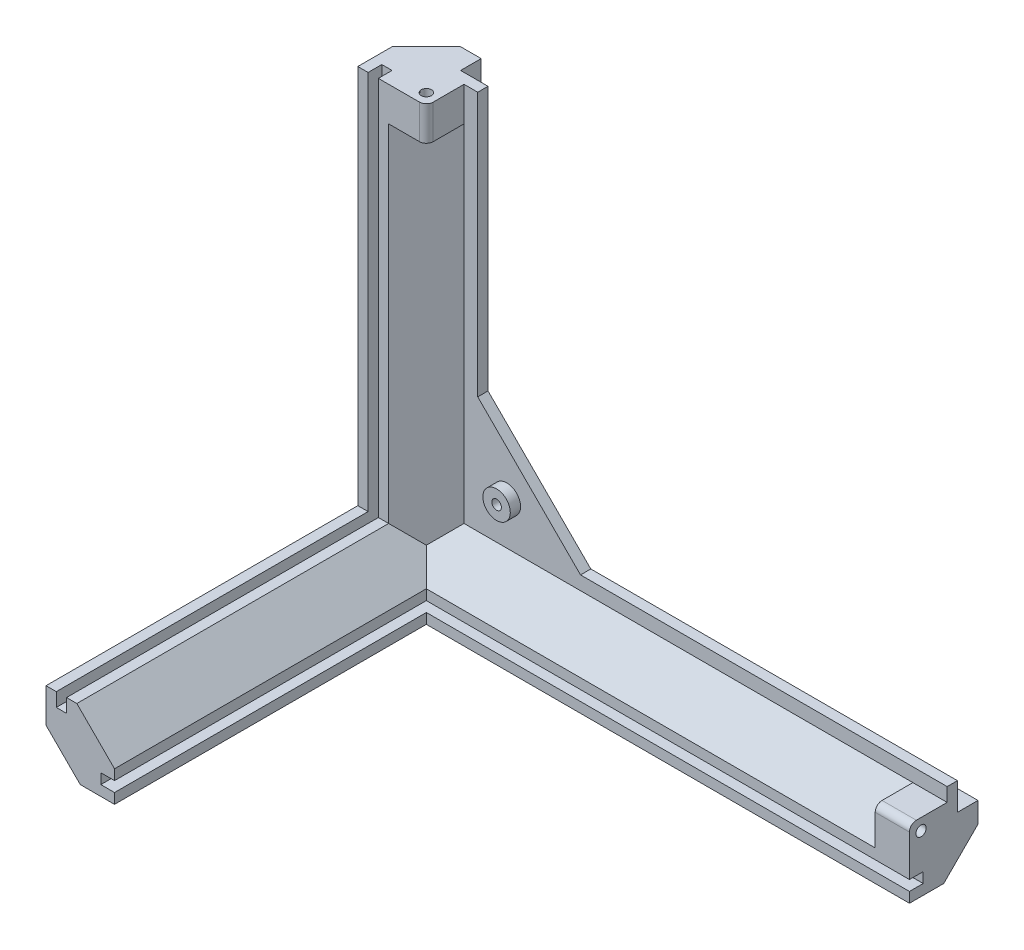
ISO-10303-21;
HEADER;
FILE_DESCRIPTION(('STEP AP214'),'2;1');
FILE_NAME('part.step','',(''),(''),'','','');
FILE_SCHEMA(('AUTOMOTIVE_DESIGN { 1 0 10303 214 1 1 1 1 }'));
ENDSEC;
DATA;
#1=APPLICATION_CONTEXT('core data for automotive mechanical design processes');
#2=APPLICATION_PROTOCOL_DEFINITION('international standard','automotive_design',2000,#1);
#3=PRODUCT_CONTEXT('',#1,'mechanical');
#4=PRODUCT('Part','Part','',(#3));
#5=PRODUCT_RELATED_PRODUCT_CATEGORY('part','',(#4));
#6=PRODUCT_DEFINITION_FORMATION('','',#4);
#7=PRODUCT_DEFINITION_CONTEXT('part definition',#1,'design');
#8=PRODUCT_DEFINITION('design','',#6,#7);
#9=PRODUCT_DEFINITION_SHAPE('','',#8);
#10=(LENGTH_UNIT() NAMED_UNIT(*) SI_UNIT(.MILLI.,.METRE.));
#11=(NAMED_UNIT(*) PLANE_ANGLE_UNIT() SI_UNIT($,.RADIAN.));
#12=(NAMED_UNIT(*) SI_UNIT($,.STERADIAN.) SOLID_ANGLE_UNIT());
#13=UNCERTAINTY_MEASURE_WITH_UNIT(LENGTH_MEASURE(1.E-05),#10,'distance_accuracy_value','');
#14=(GEOMETRIC_REPRESENTATION_CONTEXT(3) GLOBAL_UNCERTAINTY_ASSIGNED_CONTEXT((#13)) GLOBAL_UNIT_ASSIGNED_CONTEXT((#10,
#11,#12)) REPRESENTATION_CONTEXT('',''));
#15=CARTESIAN_POINT('',(0.,0.,0.));
#16=DIRECTION('',(0.,0.,1.));
#17=DIRECTION('',(1.,0.,0.));
#18=AXIS2_PLACEMENT_3D('',#15,#16,#17);
#19=CARTESIAN_POINT('',(100.942130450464,4.,-4.45226686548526));
#20=DIRECTION('',(0.,0.,-1.));
#21=DIRECTION('',(-1.,0.,0.));
#22=AXIS2_PLACEMENT_3D('',#19,#20,#21);
#23=PLANE('',#22);
#24=DIRECTION('',(-1.,0.,0.));
#25=VECTOR('',#24,1.);
#26=CARTESIAN_POINT('',(100.942130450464,0.,-4.45226686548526));
#27=LINE('',#26,#25);
#28=CARTESIAN_POINT('',(100.942130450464,0.,-4.45226686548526));
#29=VERTEX_POINT('',#28);
#30=CARTESIAN_POINT('',(90.9421304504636,0.,-4.45226686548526));
#31=VERTEX_POINT('',#30);
#32=EDGE_CURVE('E304',#29,#31,#27,.T.);
#33=ORIENTED_EDGE('',*,*,#32,.F.);
#34=DIRECTION('',(0.,-1.,0.));
#35=VECTOR('',#34,1.);
#36=CARTESIAN_POINT('',(100.942130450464,4.,-4.45226686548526));
#37=LINE('',#36,#35);
#38=CARTESIAN_POINT('',(100.942130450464,4.,-4.45226686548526));
#39=VERTEX_POINT('',#38);
#40=EDGE_CURVE('E398',#39,#29,#37,.T.);
#41=ORIENTED_EDGE('',*,*,#40,.F.);
#42=DIRECTION('',(1.,0.,0.));
#43=VECTOR('',#42,1.);
#44=CARTESIAN_POINT('',(100.942130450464,4.,-4.45226686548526));
#45=LINE('',#44,#43);
#46=CARTESIAN_POINT('',(-6.05786954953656,4.,-4.45226686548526));
#47=VERTEX_POINT('',#46);
#48=EDGE_CURVE('E387',#47,#39,#45,.T.);
#49=ORIENTED_EDGE('',*,*,#48,.F.);
#50=DIRECTION('',(-0.707106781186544,0.707106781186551,0.));
#51=VECTOR('',#50,1.);
#52=CARTESIAN_POINT('',(47.4421304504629,-49.5000000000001,-4.45226686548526));
#53=LINE('',#52,#51);
#54=CARTESIAN_POINT('',(-36.0578695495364,34.0000000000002,-4.45226686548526));
#55=VERTEX_POINT('',#54);
#56=EDGE_CURVE('E684',#47,#55,#53,.T.);
#57=ORIENTED_EDGE('',*,*,#56,.T.);
#58=DIRECTION('',(0.,-1.,0.));
#59=VECTOR('',#58,1.);
#60=CARTESIAN_POINT('',(-36.0578695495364,111.,-4.45226686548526));
#61=LINE('',#60,#59);
#62=CARTESIAN_POINT('',(-36.0578695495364,111.,-4.45226686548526));
#63=VERTEX_POINT('',#62);
#64=EDGE_CURVE('E373',#63,#55,#61,.T.);
#65=ORIENTED_EDGE('',*,*,#64,.F.);
#66=DIRECTION('',(-1.,0.,0.));
#67=VECTOR('',#66,1.);
#68=CARTESIAN_POINT('',(-36.0578695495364,111.,-4.45226686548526));
#69=LINE('',#68,#67);
#70=CARTESIAN_POINT('',(-40.0578695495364,111.,-4.45226686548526));
#71=VERTEX_POINT('',#70);
#72=EDGE_CURVE('E383',#63,#71,#69,.T.);
#73=ORIENTED_EDGE('',*,*,#72,.T.);
#74=DIRECTION('',(0.,-1.,0.));
#75=VECTOR('',#74,1.);
#76=CARTESIAN_POINT('',(-40.0578695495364,111.,-4.45226686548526));
#77=LINE('',#76,#75);
#78=CARTESIAN_POINT('',(-40.0578695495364,101.,-4.45226686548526));
#79=VERTEX_POINT('',#78);
#80=EDGE_CURVE('E637',#71,#79,#77,.T.);
#81=ORIENTED_EDGE('',*,*,#80,.T.);
#82=CARTESIAN_POINT('',(-40.0578695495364,0.,-4.45226686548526));
#83=VERTEX_POINT('',#82);
#84=EDGE_CURVE('E308',#79,#83,#77,.T.);
#85=ORIENTED_EDGE('',*,*,#84,.T.);
#86=EDGE_CURVE('E299',#31,#83,#27,.T.);
#87=ORIENTED_EDGE('',*,*,#86,.F.);
#88=EDGE_LOOP('',(#33,#41,#49,#57,#65,#73,#81,#85,#87));
#89=FACE_BOUND('',#88,.T.);
#90=CARTESIAN_POINT('',(-27.5578695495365,12.5000000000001,-4.45226686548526));
#91=DIRECTION('',(0.,0.,-1.));
#92=DIRECTION('',(-1.,0.,0.));
#93=AXIS2_PLACEMENT_3D('',#90,#91,#92);
#94=CIRCLE('',#93,4.);
#95=CARTESIAN_POINT('',(-31.5578695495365,12.5000000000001,-4.45226686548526));
#96=VERTEX_POINT('',#95);
#97=EDGE_CURVE('E12',#96,#96,#94,.F.);
#98=ORIENTED_EDGE('',*,*,#97,.F.);
#99=EDGE_LOOP('',(#98));
#100=FACE_BOUND('',#99,.T.);
#101=ADVANCED_FACE('F53',(#89,#100),#23,.F.);
#102=CARTESIAN_POINT('',(-40.0578695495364,111.,-4.45226686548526));
#103=DIRECTION('',(-0.707106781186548,0.,-0.707106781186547));
#104=DIRECTION('',(-0.707106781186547,0.,0.707106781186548));
#105=AXIS2_PLACEMENT_3D('',#102,#103,#104);
#106=PLANE('',#105);
#107=DIRECTION('',(0.707106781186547,0.,-0.707106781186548));
#108=VECTOR('',#107,1.);
#109=CARTESIAN_POINT('',(-22.2550682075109,101.,-22.2550682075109));
#110=LINE('',#109,#108);
#111=CARTESIAN_POINT('',(-51.0578695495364,101.,6.54773313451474));
#112=VERTEX_POINT('',#111);
#113=EDGE_CURVE('E360',#112,#79,#110,.T.);
#114=ORIENTED_EDGE('',*,*,#113,.F.);
#115=DIRECTION('',(0.,-1.,0.));
#116=VECTOR('',#115,1.);
#117=CARTESIAN_POINT('',(-51.0578695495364,111.,6.54773313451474));
#118=LINE('',#117,#116);
#119=CARTESIAN_POINT('',(-51.0578695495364,0.,6.54773313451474));
#120=VERTEX_POINT('',#119);
#121=EDGE_CURVE('E640',#112,#120,#118,.T.);
#122=ORIENTED_EDGE('',*,*,#121,.T.);
#123=DIRECTION('',(-0.577350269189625,0.577350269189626,0.577350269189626));
#124=VECTOR('',#123,1.);
#125=CARTESIAN_POINT('',(-80.7245362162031,29.6666666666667,36.2143998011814));
#126=LINE('',#125,#124);
#127=CARTESIAN_POINT('',(-45.5578695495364,-5.49999999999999,1.04773313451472));
#128=VERTEX_POINT('',#127);
#129=EDGE_CURVE('E411',#128,#120,#126,.T.);
#130=ORIENTED_EDGE('',*,*,#129,.F.);
#131=DIRECTION('',(-0.577350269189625,-0.577350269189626,0.577350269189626));
#132=VECTOR('',#131,1.);
#133=CARTESIAN_POINT('',(-3.05786954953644,37.,-41.4522668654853));
#134=LINE('',#133,#132);
#135=EDGE_CURVE('E415',#83,#128,#134,.T.);
#136=ORIENTED_EDGE('',*,*,#135,.F.);
#137=ORIENTED_EDGE('',*,*,#84,.F.);
#138=EDGE_LOOP('',(#114,#122,#130,#136,#137));
#139=FACE_BOUND('',#138,.T.);
#140=ADVANCED_FACE('F744',(#139),#106,.F.);
#141=CARTESIAN_POINT('',(100.942130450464,-11.,6.54773313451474));
#142=DIRECTION('',(0.,-0.707106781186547,-0.707106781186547));
#143=DIRECTION('',(0.,0.707106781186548,-0.707106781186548));
#144=AXIS2_PLACEMENT_3D('',#141,#142,#143);
#145=PLANE('',#144);
#146=DIRECTION('',(-1.,0.,0.));
#147=VECTOR('',#146,1.);
#148=CARTESIAN_POINT('',(100.942130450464,-11.,6.54773313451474));
#149=LINE('',#148,#147);
#150=CARTESIAN_POINT('',(90.9421304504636,-11.,6.54773313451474));
#151=VERTEX_POINT('',#150);
#152=CARTESIAN_POINT('',(-40.0578695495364,-11.,6.54773313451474));
#153=VERTEX_POINT('',#152);
#154=EDGE_CURVE('E320',#151,#153,#149,.T.);
#155=ORIENTED_EDGE('',*,*,#154,.F.);
#156=DIRECTION('',(0.,0.707106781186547,-0.707106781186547));
#157=VECTOR('',#156,1.);
#158=CARTESIAN_POINT('',(90.9421304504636,-11.,6.54773313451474));
#159=LINE('',#158,#157);
#160=EDGE_CURVE('E317',#151,#31,#159,.T.);
#161=ORIENTED_EDGE('',*,*,#160,.T.);
#162=ORIENTED_EDGE('',*,*,#86,.T.);
#163=ORIENTED_EDGE('',*,*,#135,.T.);
#164=DIRECTION('',(-0.577350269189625,0.577350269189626,-0.577350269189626));
#165=VECTOR('',#164,1.);
#166=CARTESIAN_POINT('',(6.94213045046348,-58.,53.5477331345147));
#167=LINE('',#166,#165);
#168=EDGE_CURVE('E408',#153,#128,#167,.T.);
#169=ORIENTED_EDGE('',*,*,#168,.F.);
#170=EDGE_LOOP('',(#155,#161,#162,#163,#169));
#171=FACE_BOUND('',#170,.T.);
#172=ADVANCED_FACE('F318',(#171),#145,.F.);
#173=CARTESIAN_POINT('',(-40.0578695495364,111.,-7.45226686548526));
#174=DIRECTION('',(-1.,0.,0.));
#175=DIRECTION('',(0.,0.,1.));
#176=AXIS2_PLACEMENT_3D('',#173,#174,#175);
#177=PLANE('',#176);
#178=DIRECTION('',(0.,-1.,0.));
#179=VECTOR('',#178,1.);
#180=CARTESIAN_POINT('',(-40.0578695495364,-17.,6.54773313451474));
#181=LINE('',#180,#179);
#182=CARTESIAN_POINT('',(-40.0578695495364,-17.,6.54773313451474));
#183=VERTEX_POINT('',#182);
#184=CARTESIAN_POINT('',(-40.0578695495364,-20.,6.54773313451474));
#185=VERTEX_POINT('',#184);
#186=EDGE_CURVE('E435',#183,#185,#181,.T.);
#187=ORIENTED_EDGE('',*,*,#186,.F.);
#188=DIRECTION('',(0.,0.,-1.));
#189=VECTOR('',#188,1.);
#190=CARTESIAN_POINT('',(-40.0578695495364,-17.,97.5477331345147));
#191=LINE('',#190,#189);
#192=CARTESIAN_POINT('',(-40.0578695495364,-17.,97.5477331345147));
#193=VERTEX_POINT('',#192);
#194=EDGE_CURVE('E568',#193,#183,#191,.T.);
#195=ORIENTED_EDGE('',*,*,#194,.F.);
#196=DIRECTION('',(0.,1.,0.));
#197=VECTOR('',#196,1.);
#198=CARTESIAN_POINT('',(-40.0578695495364,-20.,97.5477331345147));
#199=LINE('',#198,#197);
#200=CARTESIAN_POINT('',(-40.0578695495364,-20.,97.5477331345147));
#201=VERTEX_POINT('',#200);
#202=EDGE_CURVE('E527',#201,#193,#199,.T.);
#203=ORIENTED_EDGE('',*,*,#202,.F.);
#204=DIRECTION('',(0.,0.,-1.));
#205=VECTOR('',#204,1.);
#206=CARTESIAN_POINT('',(-40.0578695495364,-20.,6.54773313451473));
#207=LINE('',#206,#205);
#208=EDGE_CURVE('E600',#201,#185,#207,.T.);
#209=ORIENTED_EDGE('',*,*,#208,.T.);
#210=EDGE_LOOP('',(#187,#195,#203,#209));
#211=FACE_BOUND('',#210,.T.);
#212=ADVANCED_FACE('F784',(#211),#177,.F.);
#213=DIRECTION('',(0.,-1.,0.));
#214=VECTOR('',#213,1.);
#215=CARTESIAN_POINT('',(-40.0578695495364,-11.,6.54773313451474));
#216=LINE('',#215,#214);
#217=CARTESIAN_POINT('',(-40.0578695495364,-14.,6.54773313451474));
#218=VERTEX_POINT('',#217);
#219=EDGE_CURVE('E430',#153,#218,#216,.T.);
#220=ORIENTED_EDGE('',*,*,#219,.F.);
#221=DIRECTION('',(0.,0.,-1.));
#222=VECTOR('',#221,1.);
#223=CARTESIAN_POINT('',(-40.0578695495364,-11.,97.5477331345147));
#224=LINE('',#223,#222);
#225=CARTESIAN_POINT('',(-40.0578695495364,-11.,97.5477331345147));
#226=VERTEX_POINT('',#225);
#227=EDGE_CURVE('E555',#226,#153,#224,.T.);
#228=ORIENTED_EDGE('',*,*,#227,.F.);
#229=DIRECTION('',(0.,1.,0.));
#230=VECTOR('',#229,1.);
#231=CARTESIAN_POINT('',(-40.0578695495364,-14.,97.5477331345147));
#232=LINE('',#231,#230);
#233=CARTESIAN_POINT('',(-40.0578695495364,-14.,97.5477331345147));
#234=VERTEX_POINT('',#233);
#235=EDGE_CURVE('E539',#234,#226,#232,.T.);
#236=ORIENTED_EDGE('',*,*,#235,.F.);
#237=DIRECTION('',(0.,0.,-1.));
#238=VECTOR('',#237,1.);
#239=CARTESIAN_POINT('',(-40.0578695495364,-14.,97.5477331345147));
#240=LINE('',#239,#238);
#241=EDGE_CURVE('E559',#234,#218,#240,.T.);
#242=ORIENTED_EDGE('',*,*,#241,.T.);
#243=EDGE_LOOP('',(#220,#228,#236,#242));
#244=FACE_BOUND('',#243,.T.);
#245=ADVANCED_FACE('F837',(#244),#177,.F.);
#246=CARTESIAN_POINT('',(-54.0578695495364,111.,6.54773313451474));
#247=DIRECTION('',(0.,0.,-1.));
#248=DIRECTION('',(-1.,0.,0.));
#249=AXIS2_PLACEMENT_3D('',#246,#247,#248);
#250=PLANE('',#249);
#251=DIRECTION('',(-1.,0.,0.));
#252=VECTOR('',#251,1.);
#253=CARTESIAN_POINT('',(0.,101.,6.54773313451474));
#254=LINE('',#253,#252);
#255=CARTESIAN_POINT('',(-42.0578695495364,101.,6.54773313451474));
#256=VERTEX_POINT('',#255);
#257=EDGE_CURVE('E364',#256,#112,#254,.T.);
#258=ORIENTED_EDGE('',*,*,#257,.F.);
#259=DIRECTION('',(0.,1.,0.));
#260=VECTOR('',#259,1.);
#261=CARTESIAN_POINT('',(-42.0578695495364,111.,6.54773313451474));
#262=LINE('',#261,#260);
#263=CARTESIAN_POINT('',(-42.0578695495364,111.,6.54773313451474));
#264=VERTEX_POINT('',#263);
#265=EDGE_CURVE('E711',#256,#264,#262,.T.);
#266=ORIENTED_EDGE('',*,*,#265,.T.);
#267=DIRECTION('',(1.,0.,0.));
#268=VECTOR('',#267,1.);
#269=CARTESIAN_POINT('',(-54.0578695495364,111.,6.54773313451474));
#270=LINE('',#269,#268);
#271=CARTESIAN_POINT('',(-54.0578695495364,111.,6.54773313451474));
#272=VERTEX_POINT('',#271);
#273=EDGE_CURVE('E624',#272,#264,#270,.T.);
#274=ORIENTED_EDGE('',*,*,#273,.F.);
#275=DIRECTION('',(0.,-1.,0.));
#276=VECTOR('',#275,1.);
#277=CARTESIAN_POINT('',(-54.0578695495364,111.,6.54773313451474));
#278=LINE('',#277,#276);
#279=CARTESIAN_POINT('',(-54.0578695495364,0.,6.54773313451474));
#280=VERTEX_POINT('',#279);
#281=EDGE_CURVE('E643',#272,#280,#278,.T.);
#282=ORIENTED_EDGE('',*,*,#281,.T.);
#283=DIRECTION('',(-1.,0.,0.));
#284=VECTOR('',#283,1.);
#285=CARTESIAN_POINT('',(-54.0578695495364,0.,6.54773313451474));
#286=LINE('',#285,#284);
#287=EDGE_CURVE('E499',#120,#280,#286,.T.);
#288=ORIENTED_EDGE('',*,*,#287,.F.);
#289=ORIENTED_EDGE('',*,*,#121,.F.);
#290=EDGE_LOOP('',(#258,#266,#274,#282,#288,#289));
#291=FACE_BOUND('',#290,.T.);
#292=ADVANCED_FACE('F728',(#291),#250,.F.);
#293=DIRECTION('',(-1.,0.,0.));
#294=VECTOR('',#293,1.);
#295=CARTESIAN_POINT('',(-57.0578695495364,0.,6.54773313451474));
#296=LINE('',#295,#294);
#297=CARTESIAN_POINT('',(-57.0578695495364,0.,6.54773313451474));
#298=VERTEX_POINT('',#297);
#299=CARTESIAN_POINT('',(-60.0578695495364,0.,6.54773313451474));
#300=VERTEX_POINT('',#299);
#301=EDGE_CURVE('E505',#298,#300,#296,.T.);
#302=ORIENTED_EDGE('',*,*,#301,.F.);
#303=DIRECTION('',(0.,-1.,0.));
#304=VECTOR('',#303,1.);
#305=CARTESIAN_POINT('',(-57.0578695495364,111.,6.54773313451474));
#306=LINE('',#305,#304);
#307=CARTESIAN_POINT('',(-57.0578695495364,111.,6.54773313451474));
#308=VERTEX_POINT('',#307);
#309=EDGE_CURVE('E652',#308,#298,#306,.T.);
#310=ORIENTED_EDGE('',*,*,#309,.F.);
#311=DIRECTION('',(1.,0.,0.));
#312=VECTOR('',#311,1.);
#313=CARTESIAN_POINT('',(-60.0578695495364,111.,6.54773313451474));
#314=LINE('',#313,#312);
#315=CARTESIAN_POINT('',(-60.0578695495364,111.,6.54773313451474));
#316=VERTEX_POINT('',#315);
#317=EDGE_CURVE('E612',#316,#308,#314,.T.);
#318=ORIENTED_EDGE('',*,*,#317,.F.);
#319=DIRECTION('',(0.,-1.,0.));
#320=VECTOR('',#319,1.);
#321=CARTESIAN_POINT('',(-60.0578695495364,111.,6.54773313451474));
#322=LINE('',#321,#320);
#323=EDGE_CURVE('E656',#316,#300,#322,.T.);
#324=ORIENTED_EDGE('',*,*,#323,.T.);
#325=EDGE_LOOP('',(#302,#310,#318,#324));
#326=FACE_BOUND('',#325,.T.);
#327=ADVANCED_FACE('F841',(#326),#250,.F.);
#328=CARTESIAN_POINT('',(-50.0578695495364,111.,-13.4522668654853));
#329=DIRECTION('',(0.,0.,1.));
#330=DIRECTION('',(1.,0.,0.));
#331=AXIS2_PLACEMENT_3D('',#328,#329,#330);
#332=PLANE('',#331);
#333=DIRECTION('',(0.,-1.,0.));
#334=VECTOR('',#333,1.);
#335=CARTESIAN_POINT('',(-44.0578695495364,111.,-13.4522668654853));
#336=LINE('',#335,#334);
#337=CARTESIAN_POINT('',(-44.0578695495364,111.,-13.4522668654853));
#338=VERTEX_POINT('',#337);
#339=CARTESIAN_POINT('',(-44.0578695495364,16.0000000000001,-13.4522668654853));
#340=VERTEX_POINT('',#339);
#341=EDGE_CURVE('E404',#338,#340,#336,.T.);
#342=ORIENTED_EDGE('',*,*,#341,.T.);
#343=DIRECTION('',(-0.707106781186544,0.707106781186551,0.));
#344=VECTOR('',#343,1.);
#345=CARTESIAN_POINT('',(-94.5578695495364,66.5000000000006,-13.4522668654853));
#346=LINE('',#345,#344);
#347=CARTESIAN_POINT('',(-24.0578695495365,-4.,-13.4522668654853));
#348=VERTEX_POINT('',#347);
#349=EDGE_CURVE('E697',#340,#348,#346,.F.);
#350=ORIENTED_EDGE('',*,*,#349,.T.);
#351=DIRECTION('',(1.,0.,0.));
#352=VECTOR('',#351,1.);
#353=CARTESIAN_POINT('',(-50.0578695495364,-4.,-13.4522668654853));
#354=LINE('',#353,#352);
#355=CARTESIAN_POINT('',(100.942130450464,-4.,-13.4522668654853));
#356=VERTEX_POINT('',#355);
#357=EDGE_CURVE('E401',#348,#356,#354,.T.);
#358=ORIENTED_EDGE('',*,*,#357,.T.);
#359=DIRECTION('',(0.,1.,0.));
#360=VECTOR('',#359,1.);
#361=CARTESIAN_POINT('',(100.942130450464,0.,-13.4522668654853));
#362=LINE('',#361,#360);
#363=CARTESIAN_POINT('',(100.942130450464,-10.,-13.4522668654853));
#364=VERTEX_POINT('',#363);
#365=EDGE_CURVE('E453',#364,#356,#362,.T.);
#366=ORIENTED_EDGE('',*,*,#365,.F.);
#367=DIRECTION('',(-1.,0.,0.));
#368=VECTOR('',#367,1.);
#369=CARTESIAN_POINT('',(100.942130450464,-10.,-13.4522668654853));
#370=LINE('',#369,#368);
#371=CARTESIAN_POINT('',(-50.0578695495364,-9.99999999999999,-13.4522668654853));
#372=VERTEX_POINT('',#371);
#373=EDGE_CURVE('E471',#364,#372,#370,.T.);
#374=ORIENTED_EDGE('',*,*,#373,.T.);
#375=DIRECTION('',(0.,-1.,0.));
#376=VECTOR('',#375,1.);
#377=CARTESIAN_POINT('',(-50.0578695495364,111.,-13.4522668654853));
#378=LINE('',#377,#376);
#379=CARTESIAN_POINT('',(-50.0578695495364,111.,-13.4522668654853));
#380=VERTEX_POINT('',#379);
#381=EDGE_CURVE('E662',#380,#372,#378,.T.);
#382=ORIENTED_EDGE('',*,*,#381,.F.);
#383=DIRECTION('',(-1.,0.,0.));
#384=VECTOR('',#383,1.);
#385=CARTESIAN_POINT('',(-50.0578695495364,111.,-13.4522668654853));
#386=LINE('',#385,#384);
#387=EDGE_CURVE('E603',#338,#380,#386,.T.);
#388=ORIENTED_EDGE('',*,*,#387,.F.);
#389=EDGE_LOOP('',(#342,#350,#358,#366,#374,#382,#388));
#390=FACE_BOUND('',#389,.T.);
#391=ADVANCED_FACE('F860',(#390),#332,.F.);
#392=CARTESIAN_POINT('',(-60.0578695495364,111.,-3.45226686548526));
#393=DIRECTION('',(0.707106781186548,0.,0.707106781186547));
#394=DIRECTION('',(0.707106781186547,0.,-0.707106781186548));
#395=AXIS2_PLACEMENT_3D('',#392,#393,#394);
#396=PLANE('',#395);
#397=ORIENTED_EDGE('',*,*,#381,.T.);
#398=DIRECTION('',(-0.577350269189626,-0.577350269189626,0.577350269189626));
#399=VECTOR('',#398,1.);
#400=CARTESIAN_POINT('',(-16.3912028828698,23.6666666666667,-47.1189335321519));
#401=LINE('',#400,#399);
#402=CARTESIAN_POINT('',(-55.0578695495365,-15.,-8.45226686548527));
#403=VERTEX_POINT('',#402);
#404=EDGE_CURVE('E426',#372,#403,#401,.T.);
#405=ORIENTED_EDGE('',*,*,#404,.T.);
#406=DIRECTION('',(0.577350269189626,-0.577350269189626,-0.577350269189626));
#407=VECTOR('',#406,1.);
#408=CARTESIAN_POINT('',(-87.0578695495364,17.,23.5477331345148));
#409=LINE('',#408,#407);
#410=CARTESIAN_POINT('',(-60.0578695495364,-10.,-3.45226686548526));
#411=VERTEX_POINT('',#410);
#412=EDGE_CURVE('E666',#411,#403,#409,.T.);
#413=ORIENTED_EDGE('',*,*,#412,.F.);
#414=DIRECTION('',(0.,-1.,0.));
#415=VECTOR('',#414,1.);
#416=CARTESIAN_POINT('',(-60.0578695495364,111.,-3.45226686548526));
#417=LINE('',#416,#415);
#418=CARTESIAN_POINT('',(-60.0578695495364,111.,-3.45226686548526));
#419=VERTEX_POINT('',#418);
#420=EDGE_CURVE('E659',#419,#411,#417,.T.);
#421=ORIENTED_EDGE('',*,*,#420,.F.);
#422=DIRECTION('',(-0.707106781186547,0.,0.707106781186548));
#423=VECTOR('',#422,1.);
#424=CARTESIAN_POINT('',(-60.0578695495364,111.,-3.45226686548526));
#425=LINE('',#424,#423);
#426=EDGE_CURVE('E606',#380,#419,#425,.T.);
#427=ORIENTED_EDGE('',*,*,#426,.F.);
#428=EDGE_LOOP('',(#397,#405,#413,#421,#427));
#429=FACE_BOUND('',#428,.T.);
#430=ADVANCED_FACE('F856',(#429),#396,.F.);
#431=CARTESIAN_POINT('',(-60.0578695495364,111.,-3.45226686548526));
#432=DIRECTION('',(1.,0.,0.));
#433=DIRECTION('',(0.,0.,-1.));
#434=AXIS2_PLACEMENT_3D('',#431,#432,#433);
#435=PLANE('',#434);
#436=ORIENTED_EDGE('',*,*,#420,.T.);
#437=DIRECTION('',(0.,0.,-1.));
#438=VECTOR('',#437,1.);
#439=CARTESIAN_POINT('',(-60.0578695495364,-10.,97.5477331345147));
#440=LINE('',#439,#438);
#441=CARTESIAN_POINT('',(-60.0578695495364,-10.,97.5477331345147));
#442=VERTEX_POINT('',#441);
#443=EDGE_CURVE('E576',#442,#411,#440,.T.);
#444=ORIENTED_EDGE('',*,*,#443,.F.);
#445=DIRECTION('',(0.,-1.,0.));
#446=VECTOR('',#445,1.);
#447=CARTESIAN_POINT('',(-60.0578695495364,0.,97.5477331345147));
#448=LINE('',#447,#446);
#449=CARTESIAN_POINT('',(-60.0578695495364,0.,97.5477331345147));
#450=VERTEX_POINT('',#449);
#451=EDGE_CURVE('E517',#450,#442,#448,.T.);
#452=ORIENTED_EDGE('',*,*,#451,.F.);
#453=DIRECTION('',(0.,0.,-1.));
#454=VECTOR('',#453,1.);
#455=CARTESIAN_POINT('',(-60.0578695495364,0.,97.5477331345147));
#456=LINE('',#455,#454);
#457=EDGE_CURVE('E580',#450,#300,#456,.T.);
#458=ORIENTED_EDGE('',*,*,#457,.T.);
#459=ORIENTED_EDGE('',*,*,#323,.F.);
#460=DIRECTION('',(0.,0.,1.));
#461=VECTOR('',#460,1.);
#462=CARTESIAN_POINT('',(-60.0578695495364,111.,-3.45226686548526));
#463=LINE('',#462,#461);
#464=EDGE_CURVE('E609',#419,#316,#463,.T.);
#465=ORIENTED_EDGE('',*,*,#464,.F.);
#466=EDGE_LOOP('',(#436,#444,#452,#458,#459,#465));
#467=FACE_BOUND('',#466,.T.);
#468=ADVANCED_FACE('F852',(#467),#435,.F.);
#469=CARTESIAN_POINT('',(-57.0578695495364,111.,6.54773313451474));
#470=DIRECTION('',(-1.,0.,0.));
#471=DIRECTION('',(0.,0.,1.));
#472=AXIS2_PLACEMENT_3D('',#469,#470,#471);
#473=PLANE('',#472);
#474=ORIENTED_EDGE('',*,*,#309,.T.);
#475=DIRECTION('',(0.,0.,-1.));
#476=VECTOR('',#475,1.);
#477=CARTESIAN_POINT('',(-57.0578695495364,0.,97.5477331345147));
#478=LINE('',#477,#476);
#479=CARTESIAN_POINT('',(-57.0578695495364,0.,97.5477331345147));
#480=VERTEX_POINT('',#479);
#481=EDGE_CURVE('E584',#480,#298,#478,.T.);
#482=ORIENTED_EDGE('',*,*,#481,.F.);
#483=DIRECTION('',(0.,1.,0.));
#484=VECTOR('',#483,1.);
#485=CARTESIAN_POINT('',(-57.0578695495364,0.,97.5477331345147));
#486=LINE('',#485,#484);
#487=CARTESIAN_POINT('',(-57.0578695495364,-4.,97.5477331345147));
#488=VERTEX_POINT('',#487);
#489=EDGE_CURVE('E511',#488,#480,#486,.T.);
#490=ORIENTED_EDGE('',*,*,#489,.F.);
#491=DIRECTION('',(0.,0.,-1.));
#492=VECTOR('',#491,1.);
#493=CARTESIAN_POINT('',(-57.0578695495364,-4.,97.5477331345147));
#494=LINE('',#493,#492);
#495=CARTESIAN_POINT('',(-57.0578695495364,-3.99999999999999,2.54773313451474));
#496=VERTEX_POINT('',#495);
#497=EDGE_CURVE('E588',#488,#496,#494,.T.);
#498=ORIENTED_EDGE('',*,*,#497,.T.);
#499=DIRECTION('',(0.,-1.,0.));
#500=VECTOR('',#499,1.);
#501=CARTESIAN_POINT('',(-57.0578695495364,111.,2.54773313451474));
#502=LINE('',#501,#500);
#503=CARTESIAN_POINT('',(-57.0578695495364,111.,2.54773313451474));
#504=VERTEX_POINT('',#503);
#505=EDGE_CURVE('E649',#504,#496,#502,.T.);
#506=ORIENTED_EDGE('',*,*,#505,.F.);
#507=DIRECTION('',(0.,0.,-1.));
#508=VECTOR('',#507,1.);
#509=CARTESIAN_POINT('',(-57.0578695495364,111.,6.54773313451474));
#510=LINE('',#509,#508);
#511=EDGE_CURVE('E615',#308,#504,#510,.T.);
#512=ORIENTED_EDGE('',*,*,#511,.F.);
#513=EDGE_LOOP('',(#474,#482,#490,#498,#506,#512));
#514=FACE_BOUND('',#513,.T.);
#515=ADVANCED_FACE('F848',(#514),#473,.F.);
#516=CARTESIAN_POINT('',(-57.0578695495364,111.,2.54773313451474));
#517=DIRECTION('',(0.,0.,-1.));
#518=DIRECTION('',(-1.,0.,0.));
#519=AXIS2_PLACEMENT_3D('',#516,#517,#518);
#520=PLANE('',#519);
#521=ORIENTED_EDGE('',*,*,#505,.T.);
#522=DIRECTION('',(-1.,0.,0.));
#523=VECTOR('',#522,1.);
#524=CARTESIAN_POINT('',(-57.0578695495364,-3.99999999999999,2.54773313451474));
#525=LINE('',#524,#523);
#526=CARTESIAN_POINT('',(-54.0578695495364,-3.99999999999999,2.54773313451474));
#527=VERTEX_POINT('',#526);
#528=EDGE_CURVE('E418',#527,#496,#525,.T.);
#529=ORIENTED_EDGE('',*,*,#528,.F.);
#530=DIRECTION('',(0.,-1.,0.));
#531=VECTOR('',#530,1.);
#532=CARTESIAN_POINT('',(-54.0578695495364,111.,2.54773313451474));
#533=LINE('',#532,#531);
#534=CARTESIAN_POINT('',(-54.0578695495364,111.,2.54773313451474));
#535=VERTEX_POINT('',#534);
#536=EDGE_CURVE('E646',#535,#527,#533,.T.);
#537=ORIENTED_EDGE('',*,*,#536,.F.);
#538=DIRECTION('',(1.,0.,0.));
#539=VECTOR('',#538,1.);
#540=CARTESIAN_POINT('',(-57.0578695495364,111.,2.54773313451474));
#541=LINE('',#540,#539);
#542=EDGE_CURVE('E618',#504,#535,#541,.T.);
#543=ORIENTED_EDGE('',*,*,#542,.F.);
#544=EDGE_LOOP('',(#521,#529,#537,#543));
#545=FACE_BOUND('',#544,.T.);
#546=ADVANCED_FACE('F844',(#545),#520,.F.);
#547=CARTESIAN_POINT('',(-54.0578695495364,111.,2.54773313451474));
#548=DIRECTION('',(1.,0.,0.));
#549=DIRECTION('',(0.,0.,-1.));
#550=AXIS2_PLACEMENT_3D('',#547,#548,#549);
#551=PLANE('',#550);
#552=ORIENTED_EDGE('',*,*,#536,.T.);
#553=DIRECTION('',(0.,0.,-1.));
#554=VECTOR('',#553,1.);
#555=CARTESIAN_POINT('',(-54.0578695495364,-4.,97.5477331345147));
#556=LINE('',#555,#554);
#557=CARTESIAN_POINT('',(-54.0578695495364,-4.,97.5477331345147));
#558=VERTEX_POINT('',#557);
#559=EDGE_CURVE('E592',#558,#527,#556,.T.);
#560=ORIENTED_EDGE('',*,*,#559,.F.);
#561=DIRECTION('',(0.,-1.,0.));
#562=VECTOR('',#561,1.);
#563=CARTESIAN_POINT('',(-54.0578695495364,-4.,97.5477331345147));
#564=LINE('',#563,#562);
#565=CARTESIAN_POINT('',(-54.0578695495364,0.,97.5477331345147));
#566=VERTEX_POINT('',#565);
#567=EDGE_CURVE('E504',#566,#558,#564,.T.);
#568=ORIENTED_EDGE('',*,*,#567,.F.);
#569=DIRECTION('',(0.,0.,-1.));
#570=VECTOR('',#569,1.);
#571=CARTESIAN_POINT('',(-54.0578695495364,0.,97.5477331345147));
#572=LINE('',#571,#570);
#573=EDGE_CURVE('E596',#566,#280,#572,.T.);
#574=ORIENTED_EDGE('',*,*,#573,.T.);
#575=ORIENTED_EDGE('',*,*,#281,.F.);
#576=DIRECTION('',(0.,0.,1.));
#577=VECTOR('',#576,1.);
#578=CARTESIAN_POINT('',(-54.0578695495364,111.,2.54773313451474));
#579=LINE('',#578,#577);
#580=EDGE_CURVE('E621',#535,#272,#579,.T.);
#581=ORIENTED_EDGE('',*,*,#580,.F.);
#582=EDGE_LOOP('',(#552,#560,#568,#574,#575,#581));
#583=FACE_BOUND('',#582,.T.);
#584=ADVANCED_FACE('F834',(#583),#551,.F.);
#585=CARTESIAN_POINT('',(-44.0578695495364,111.,-7.45226686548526));
#586=DIRECTION('',(0.,0.,1.));
#587=DIRECTION('',(1.,0.,0.));
#588=AXIS2_PLACEMENT_3D('',#585,#586,#587);
#589=PLANE('',#588);
#590=CARTESIAN_POINT('',(-27.5578695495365,12.5000000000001,-7.45226686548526));
#591=DIRECTION('',(0.,0.,-1.));
#592=DIRECTION('',(-1.,0.,0.));
#593=AXIS2_PLACEMENT_3D('',#590,#591,#592);
#594=CIRCLE('',#593,1.4);
#595=CARTESIAN_POINT('',(-28.9578695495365,12.5000000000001,-7.45226686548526));
#596=VERTEX_POINT('',#595);
#597=EDGE_CURVE('E366',#596,#596,#594,.T.);
#598=ORIENTED_EDGE('',*,*,#597,.F.);
#599=EDGE_LOOP('',(#598));
#600=FACE_BOUND('',#599,.T.);
#601=DIRECTION('',(-1.,0.,0.));
#602=VECTOR('',#601,1.);
#603=CARTESIAN_POINT('',(100.942130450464,-4.,-7.45226686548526));
#604=LINE('',#603,#602);
#605=CARTESIAN_POINT('',(100.942130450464,-4.,-7.45226686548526));
#606=VERTEX_POINT('',#605);
#607=CARTESIAN_POINT('',(-24.0578695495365,-4.,-7.45226686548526));
#608=VERTEX_POINT('',#607);
#609=EDGE_CURVE('E337',#606,#608,#604,.T.);
#610=ORIENTED_EDGE('',*,*,#609,.T.);
#611=DIRECTION('',(0.707106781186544,-0.707106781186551,0.));
#612=VECTOR('',#611,1.);
#613=CARTESIAN_POINT('',(-44.0578695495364,16.0000000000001,-7.45226686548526));
#614=LINE('',#613,#612);
#615=CARTESIAN_POINT('',(-44.0578695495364,16.0000000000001,-7.45226686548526));
#616=VERTEX_POINT('',#615);
#617=EDGE_CURVE('E694',#608,#616,#614,.F.);
#618=ORIENTED_EDGE('',*,*,#617,.T.);
#619=DIRECTION('',(0.,-1.,0.));
#620=VECTOR('',#619,1.);
#621=CARTESIAN_POINT('',(-44.0578695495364,111.,-7.45226686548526));
#622=LINE('',#621,#620);
#623=CARTESIAN_POINT('',(-44.0578695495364,111.,-7.45226686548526));
#624=VERTEX_POINT('',#623);
#625=EDGE_CURVE('E633',#624,#616,#622,.T.);
#626=ORIENTED_EDGE('',*,*,#625,.F.);
#627=DIRECTION('',(-1.,0.,0.));
#628=VECTOR('',#627,1.);
#629=CARTESIAN_POINT('',(-44.0578695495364,111.,-7.45226686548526));
#630=LINE('',#629,#628);
#631=CARTESIAN_POINT('',(-36.0578695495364,111.,-7.45226686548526));
#632=VERTEX_POINT('',#631);
#633=EDGE_CURVE('E627',#632,#624,#630,.T.);
#634=ORIENTED_EDGE('',*,*,#633,.F.);
#635=DIRECTION('',(0.,1.,0.));
#636=VECTOR('',#635,1.);
#637=CARTESIAN_POINT('',(-36.0578695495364,4.,-7.45226686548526));
#638=LINE('',#637,#636);
#639=CARTESIAN_POINT('',(-36.0578695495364,34.0000000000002,-7.45226686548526));
#640=VERTEX_POINT('',#639);
#641=EDGE_CURVE('E377',#640,#632,#638,.T.);
#642=ORIENTED_EDGE('',*,*,#641,.F.);
#643=DIRECTION('',(0.707106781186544,-0.707106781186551,0.));
#644=VECTOR('',#643,1.);
#645=CARTESIAN_POINT('',(-78.5578695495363,76.5000000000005,-7.45226686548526));
#646=LINE('',#645,#644);
#647=CARTESIAN_POINT('',(-6.05786954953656,4.,-7.45226686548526));
#648=VERTEX_POINT('',#647);
#649=EDGE_CURVE('E681',#640,#648,#646,.T.);
#650=ORIENTED_EDGE('',*,*,#649,.T.);
#651=DIRECTION('',(-1.,0.,0.));
#652=VECTOR('',#651,1.);
#653=CARTESIAN_POINT('',(-40.0578695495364,4.,-7.45226686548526));
#654=LINE('',#653,#652);
#655=CARTESIAN_POINT('',(100.942130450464,4.,-7.45226686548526));
#656=VERTEX_POINT('',#655);
#657=EDGE_CURVE('E394',#656,#648,#654,.T.);
#658=ORIENTED_EDGE('',*,*,#657,.F.);
#659=DIRECTION('',(0.,1.,0.));
#660=VECTOR('',#659,1.);
#661=CARTESIAN_POINT('',(100.942130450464,0.,-7.45226686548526));
#662=LINE('',#661,#660);
#663=EDGE_CURVE('E313',#606,#656,#662,.T.);
#664=ORIENTED_EDGE('',*,*,#663,.F.);
#665=EDGE_LOOP('',(#610,#618,#626,#634,#642,#650,#658,#664));
#666=FACE_BOUND('',#665,.T.);
#667=ADVANCED_FACE('F830',(#600,#666),#589,.F.);
#668=CARTESIAN_POINT('',(-44.0578695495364,111.,-10.4522668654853));
#669=DIRECTION('',(-1.,0.,0.));
#670=DIRECTION('',(0.,0.,1.));
#671=AXIS2_PLACEMENT_3D('',#668,#669,#670);
#672=PLANE('',#671);
#673=ORIENTED_EDGE('',*,*,#625,.T.);
#674=DIRECTION('',(0.,0.,-1.));
#675=VECTOR('',#674,1.);
#676=CARTESIAN_POINT('',(-44.0578695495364,16.0000000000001,-13.4522668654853));
#677=LINE('',#676,#675);
#678=EDGE_CURVE('E687',#616,#340,#677,.T.);
#679=ORIENTED_EDGE('',*,*,#678,.T.);
#680=ORIENTED_EDGE('',*,*,#341,.F.);
#681=DIRECTION('',(0.,0.,-1.));
#682=VECTOR('',#681,1.);
#683=CARTESIAN_POINT('',(-44.0578695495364,111.,-10.4522668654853));
#684=LINE('',#683,#682);
#685=EDGE_CURVE('E630',#624,#338,#684,.T.);
#686=ORIENTED_EDGE('',*,*,#685,.F.);
#687=EDGE_LOOP('',(#673,#679,#680,#686));
#688=FACE_BOUND('',#687,.T.);
#689=ADVANCED_FACE('F827',(#688),#672,.F.);
#690=CARTESIAN_POINT('',(0.,111.,0.));
#691=DIRECTION('',(0.,1.,0.));
#692=DIRECTION('',(0.,0.,1.));
#693=AXIS2_PLACEMENT_3D('',#690,#691,#692);
#694=PLANE('',#693);
#695=ORIENTED_EDGE('',*,*,#273,.T.);
#696=CARTESIAN_POINT('',(-42.0578695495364,111.,4.54773313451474));
#697=DIRECTION('',(0.,1.,0.));
#698=DIRECTION('',(0.,0.,1.));
#699=AXIS2_PLACEMENT_3D('',#696,#697,#698);
#700=CIRCLE('',#699,2.);
#701=CARTESIAN_POINT('',(-40.0578695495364,111.,4.54773313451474));
#702=VERTEX_POINT('',#701);
#703=EDGE_CURVE('E77',#264,#702,#700,.T.);
#704=ORIENTED_EDGE('',*,*,#703,.T.);
#705=DIRECTION('',(0.,0.,1.));
#706=VECTOR('',#705,1.);
#707=CARTESIAN_POINT('',(-40.0578695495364,111.,0.));
#708=LINE('',#707,#706);
#709=EDGE_CURVE('E346',#71,#702,#708,.T.);
#710=ORIENTED_EDGE('',*,*,#709,.F.);
#711=ORIENTED_EDGE('',*,*,#72,.F.);
#712=DIRECTION('',(0.,0.,1.));
#713=VECTOR('',#712,1.);
#714=CARTESIAN_POINT('',(-36.0578695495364,111.,-7.45226686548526));
#715=LINE('',#714,#713);
#716=EDGE_CURVE('E380',#632,#63,#715,.T.);
#717=ORIENTED_EDGE('',*,*,#716,.F.);
#718=ORIENTED_EDGE('',*,*,#633,.T.);
#719=ORIENTED_EDGE('',*,*,#685,.T.);
#720=ORIENTED_EDGE('',*,*,#387,.T.);
#721=ORIENTED_EDGE('',*,*,#426,.T.);
#722=ORIENTED_EDGE('',*,*,#464,.T.);
#723=ORIENTED_EDGE('',*,*,#317,.T.);
#724=ORIENTED_EDGE('',*,*,#511,.T.);
#725=ORIENTED_EDGE('',*,*,#542,.T.);
#726=ORIENTED_EDGE('',*,*,#580,.T.);
#727=EDGE_LOOP('',(#695,#704,#710,#711,#717,#718,#719,#720,#721,#722,#723,#724,#725,#726));
#728=FACE_BOUND('',#727,.T.);
#729=CARTESIAN_POINT('',(-43.4365492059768,111.,3.16905347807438));
#730=DIRECTION('',(0.,1.,0.));
#731=DIRECTION('',(0.,0.,1.));
#732=AXIS2_PLACEMENT_3D('',#729,#730,#731);
#733=CIRCLE('',#732,1.5);
#734=CARTESIAN_POINT('',(-43.4365492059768,111.,4.66905347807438));
#735=VERTEX_POINT('',#734);
#736=EDGE_CURVE('E342',#735,#735,#733,.T.);
#737=ORIENTED_EDGE('',*,*,#736,.F.);
#738=EDGE_LOOP('',(#737));
#739=FACE_BOUND('',#738,.T.);
#740=ADVANCED_FACE('F823',(#728,#739),#694,.T.);
#741=CARTESIAN_POINT('',(-40.0578695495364,-20.,6.54773313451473));
#742=DIRECTION('',(0.,-1.,0.));
#743=DIRECTION('',(0.,0.,-1.));
#744=AXIS2_PLACEMENT_3D('',#741,#742,#743);
#745=PLANE('',#744);
#746=DIRECTION('',(0.,0.,-1.));
#747=VECTOR('',#746,1.);
#748=CARTESIAN_POINT('',(-50.0578695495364,-20.,97.5477331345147));
#749=LINE('',#748,#747);
#750=CARTESIAN_POINT('',(-50.0578695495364,-20.,97.5477331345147));
#751=VERTEX_POINT('',#750);
#752=CARTESIAN_POINT('',(-50.0578695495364,-20.,-3.45226686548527));
#753=VERTEX_POINT('',#752);
#754=EDGE_CURVE('E572',#751,#753,#749,.T.);
#755=ORIENTED_EDGE('',*,*,#754,.T.);
#756=DIRECTION('',(-1.,0.,0.));
#757=VECTOR('',#756,1.);
#758=CARTESIAN_POINT('',(100.942130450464,-20.,-3.45226686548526));
#759=LINE('',#758,#757);
#760=CARTESIAN_POINT('',(100.942130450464,-20.,-3.45226686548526));
#761=VERTEX_POINT('',#760);
#762=EDGE_CURVE('E474',#761,#753,#759,.T.);
#763=ORIENTED_EDGE('',*,*,#762,.F.);
#764=DIRECTION('',(0.,0.,-1.));
#765=VECTOR('',#764,1.);
#766=CARTESIAN_POINT('',(100.942130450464,-20.,6.54773313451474));
#767=LINE('',#766,#765);
#768=CARTESIAN_POINT('',(100.942130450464,-20.,6.54773313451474));
#769=VERTEX_POINT('',#768);
#770=EDGE_CURVE('E447',#769,#761,#767,.T.);
#771=ORIENTED_EDGE('',*,*,#770,.F.);
#772=DIRECTION('',(-1.,0.,0.));
#773=VECTOR('',#772,1.);
#774=CARTESIAN_POINT('',(100.942130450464,-20.,6.54773313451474));
#775=LINE('',#774,#773);
#776=EDGE_CURVE('E477',#769,#185,#775,.T.);
#777=ORIENTED_EDGE('',*,*,#776,.T.);
#778=ORIENTED_EDGE('',*,*,#208,.F.);
#779=DIRECTION('',(1.,0.,0.));
#780=VECTOR('',#779,1.);
#781=CARTESIAN_POINT('',(-50.0578695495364,-20.,97.5477331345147));
#782=LINE('',#781,#780);
#783=EDGE_CURVE('E523',#751,#201,#782,.T.);
#784=ORIENTED_EDGE('',*,*,#783,.F.);
#785=EDGE_LOOP('',(#755,#763,#771,#777,#778,#784));
#786=FACE_BOUND('',#785,.T.);
#787=ADVANCED_FACE('F819',(#786),#745,.T.);
#788=CARTESIAN_POINT('',(-54.0578695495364,0.,97.5477331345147));
#789=DIRECTION('',(0.,-1.,0.));
#790=DIRECTION('',(0.,0.,-1.));
#791=AXIS2_PLACEMENT_3D('',#788,#789,#790);
#792=PLANE('',#791);
#793=ORIENTED_EDGE('',*,*,#287,.T.);
#794=ORIENTED_EDGE('',*,*,#573,.F.);
#795=DIRECTION('',(-1.,0.,0.));
#796=VECTOR('',#795,1.);
#797=CARTESIAN_POINT('',(-54.0578695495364,0.,97.5477331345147));
#798=LINE('',#797,#796);
#799=CARTESIAN_POINT('',(-51.0578695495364,0.,97.5477331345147));
#800=VERTEX_POINT('',#799);
#801=EDGE_CURVE('E500',#800,#566,#798,.T.);
#802=ORIENTED_EDGE('',*,*,#801,.F.);
#803=DIRECTION('',(0.,0.,-1.));
#804=VECTOR('',#803,1.);
#805=CARTESIAN_POINT('',(-51.0578695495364,0.,97.5477331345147));
#806=LINE('',#805,#804);
#807=EDGE_CURVE('E545',#800,#120,#806,.T.);
#808=ORIENTED_EDGE('',*,*,#807,.T.);
#809=EDGE_LOOP('',(#793,#794,#802,#808));
#810=FACE_BOUND('',#809,.T.);
#811=ADVANCED_FACE('F815',(#810),#792,.F.);
#812=CARTESIAN_POINT('',(-57.0578695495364,-4.,97.5477331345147));
#813=DIRECTION('',(0.,-1.,0.));
#814=DIRECTION('',(0.,0.,-1.));
#815=AXIS2_PLACEMENT_3D('',#812,#813,#814);
#816=PLANE('',#815);
#817=ORIENTED_EDGE('',*,*,#559,.T.);
#818=ORIENTED_EDGE('',*,*,#528,.T.);
#819=ORIENTED_EDGE('',*,*,#497,.F.);
#820=DIRECTION('',(-1.,0.,0.));
#821=VECTOR('',#820,1.);
#822=CARTESIAN_POINT('',(-57.0578695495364,-4.,97.5477331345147));
#823=LINE('',#822,#821);
#824=EDGE_CURVE('E508',#558,#488,#823,.T.);
#825=ORIENTED_EDGE('',*,*,#824,.F.);
#826=EDGE_LOOP('',(#817,#818,#819,#825));
#827=FACE_BOUND('',#826,.T.);
#828=ADVANCED_FACE('F811',(#827),#816,.F.);
#829=CARTESIAN_POINT('',(-57.0578695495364,0.,97.5477331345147));
#830=DIRECTION('',(0.,-1.,0.));
#831=DIRECTION('',(0.,0.,-1.));
#832=AXIS2_PLACEMENT_3D('',#829,#830,#831);
#833=PLANE('',#832);
#834=ORIENTED_EDGE('',*,*,#301,.T.);
#835=ORIENTED_EDGE('',*,*,#457,.F.);
#836=DIRECTION('',(-1.,0.,0.));
#837=VECTOR('',#836,1.);
#838=CARTESIAN_POINT('',(-57.0578695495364,0.,97.5477331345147));
#839=LINE('',#838,#837);
#840=EDGE_CURVE('E514',#480,#450,#839,.T.);
#841=ORIENTED_EDGE('',*,*,#840,.F.);
#842=ORIENTED_EDGE('',*,*,#481,.T.);
#843=EDGE_LOOP('',(#834,#835,#841,#842));
#844=FACE_BOUND('',#843,.T.);
#845=ADVANCED_FACE('F807',(#844),#833,.F.);
#846=CARTESIAN_POINT('',(-50.0578695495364,-20.,97.5477331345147));
#847=DIRECTION('',(0.707106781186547,0.707106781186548,0.));
#848=DIRECTION('',(-0.707106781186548,0.707106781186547,0.));
#849=AXIS2_PLACEMENT_3D('',#846,#847,#848);
#850=PLANE('',#849);
#851=ORIENTED_EDGE('',*,*,#412,.T.);
#852=DIRECTION('',(0.577350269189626,-0.577350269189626,0.577350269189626));
#853=VECTOR('',#852,1.);
#854=CARTESIAN_POINT('',(-16.3912028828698,-53.6666666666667,30.2143998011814));
#855=LINE('',#854,#853);
#856=EDGE_CURVE('E670',#403,#753,#855,.T.);
#857=ORIENTED_EDGE('',*,*,#856,.T.);
#858=ORIENTED_EDGE('',*,*,#754,.F.);
#859=DIRECTION('',(0.707106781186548,-0.707106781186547,0.));
#860=VECTOR('',#859,1.);
#861=CARTESIAN_POINT('',(-50.0578695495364,-20.,97.5477331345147));
#862=LINE('',#861,#860);
#863=EDGE_CURVE('E520',#442,#751,#862,.T.);
#864=ORIENTED_EDGE('',*,*,#863,.F.);
#865=ORIENTED_EDGE('',*,*,#443,.T.);
#866=EDGE_LOOP('',(#851,#857,#858,#864,#865));
#867=FACE_BOUND('',#866,.T.);
#868=ADVANCED_FACE('F803',(#867),#850,.F.);
#869=CARTESIAN_POINT('',(-40.0578695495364,-17.,97.5477331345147));
#870=DIRECTION('',(0.,-1.,0.));
#871=DIRECTION('',(0.,0.,-1.));
#872=AXIS2_PLACEMENT_3D('',#869,#870,#871);
#873=PLANE('',#872);
#874=ORIENTED_EDGE('',*,*,#194,.T.);
#875=DIRECTION('',(-1.,0.,0.));
#876=VECTOR('',#875,1.);
#877=CARTESIAN_POINT('',(100.942130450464,-17.,6.54773313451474));
#878=LINE('',#877,#876);
#879=CARTESIAN_POINT('',(100.942130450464,-17.,6.54773313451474));
#880=VERTEX_POINT('',#879);
#881=EDGE_CURVE('E481',#880,#183,#878,.T.);
#882=ORIENTED_EDGE('',*,*,#881,.F.);
#883=DIRECTION('',(0.,0.,1.));
#884=VECTOR('',#883,1.);
#885=CARTESIAN_POINT('',(100.942130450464,-17.,2.54773313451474));
#886=LINE('',#885,#884);
#887=CARTESIAN_POINT('',(100.942130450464,-17.,2.54773313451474));
#888=VERTEX_POINT('',#887);
#889=EDGE_CURVE('E441',#888,#880,#886,.T.);
#890=ORIENTED_EDGE('',*,*,#889,.F.);
#891=DIRECTION('',(-1.,0.,0.));
#892=VECTOR('',#891,1.);
#893=CARTESIAN_POINT('',(100.942130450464,-17.,2.54773313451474));
#894=LINE('',#893,#892);
#895=CARTESIAN_POINT('',(-44.0578695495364,-17.,2.54773313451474));
#896=VERTEX_POINT('',#895);
#897=EDGE_CURVE('E485',#888,#896,#894,.T.);
#898=ORIENTED_EDGE('',*,*,#897,.T.);
#899=DIRECTION('',(0.,0.,-1.));
#900=VECTOR('',#899,1.);
#901=CARTESIAN_POINT('',(-44.0578695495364,-17.,97.5477331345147));
#902=LINE('',#901,#900);
#903=CARTESIAN_POINT('',(-44.0578695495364,-17.,97.5477331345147));
#904=VERTEX_POINT('',#903);
#905=EDGE_CURVE('E565',#904,#896,#902,.T.);
#906=ORIENTED_EDGE('',*,*,#905,.F.);
#907=DIRECTION('',(-1.,0.,0.));
#908=VECTOR('',#907,1.);
#909=CARTESIAN_POINT('',(-40.0578695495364,-17.,97.5477331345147));
#910=LINE('',#909,#908);
#911=EDGE_CURVE('E530',#193,#904,#910,.T.);
#912=ORIENTED_EDGE('',*,*,#911,.F.);
#913=EDGE_LOOP('',(#874,#882,#890,#898,#906,#912));
#914=FACE_BOUND('',#913,.T.);
#915=ADVANCED_FACE('F799',(#914),#873,.F.);
#916=CARTESIAN_POINT('',(-44.0578695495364,-17.,97.5477331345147));
#917=DIRECTION('',(-1.,0.,0.));
#918=DIRECTION('',(0.,0.,1.));
#919=AXIS2_PLACEMENT_3D('',#916,#917,#918);
#920=PLANE('',#919);
#921=ORIENTED_EDGE('',*,*,#905,.T.);
#922=DIRECTION('',(0.,1.,0.));
#923=VECTOR('',#922,1.);
#924=CARTESIAN_POINT('',(-44.0578695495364,-14.,2.54773313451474));
#925=LINE('',#924,#923);
#926=CARTESIAN_POINT('',(-44.0578695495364,-14.,2.54773313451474));
#927=VERTEX_POINT('',#926);
#928=EDGE_CURVE('E422',#896,#927,#925,.T.);
#929=ORIENTED_EDGE('',*,*,#928,.T.);
#930=DIRECTION('',(0.,0.,-1.));
#931=VECTOR('',#930,1.);
#932=CARTESIAN_POINT('',(-44.0578695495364,-14.,97.5477331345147));
#933=LINE('',#932,#931);
#934=CARTESIAN_POINT('',(-44.0578695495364,-14.,97.5477331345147));
#935=VERTEX_POINT('',#934);
#936=EDGE_CURVE('E562',#935,#927,#933,.T.);
#937=ORIENTED_EDGE('',*,*,#936,.F.);
#938=DIRECTION('',(0.,1.,0.));
#939=VECTOR('',#938,1.);
#940=CARTESIAN_POINT('',(-44.0578695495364,-17.,97.5477331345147));
#941=LINE('',#940,#939);
#942=EDGE_CURVE('E533',#904,#935,#941,.T.);
#943=ORIENTED_EDGE('',*,*,#942,.F.);
#944=EDGE_LOOP('',(#921,#929,#937,#943));
#945=FACE_BOUND('',#944,.T.);
#946=ADVANCED_FACE('F795',(#945),#920,.F.);
#947=CARTESIAN_POINT('',(-44.0578695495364,-14.,97.5477331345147));
#948=DIRECTION('',(0.,1.,0.));
#949=DIRECTION('',(0.,0.,1.));
#950=AXIS2_PLACEMENT_3D('',#947,#948,#949);
#951=PLANE('',#950);
#952=ORIENTED_EDGE('',*,*,#936,.T.);
#953=DIRECTION('',(-1.,0.,0.));
#954=VECTOR('',#953,1.);
#955=CARTESIAN_POINT('',(100.942130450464,-14.,2.54773313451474));
#956=LINE('',#955,#954);
#957=CARTESIAN_POINT('',(100.942130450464,-14.,2.54773313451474));
#958=VERTEX_POINT('',#957);
#959=EDGE_CURVE('E489',#958,#927,#956,.T.);
#960=ORIENTED_EDGE('',*,*,#959,.F.);
#961=DIRECTION('',(0.,0.,-1.));
#962=VECTOR('',#961,1.);
#963=CARTESIAN_POINT('',(100.942130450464,-14.,6.54773313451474));
#964=LINE('',#963,#962);
#965=CARTESIAN_POINT('',(100.942130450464,-14.,6.54773313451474));
#966=VERTEX_POINT('',#965);
#967=EDGE_CURVE('E434',#966,#958,#964,.T.);
#968=ORIENTED_EDGE('',*,*,#967,.F.);
#969=DIRECTION('',(-1.,0.,0.));
#970=VECTOR('',#969,1.);
#971=CARTESIAN_POINT('',(100.942130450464,-14.,6.54773313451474));
#972=LINE('',#971,#970);
#973=EDGE_CURVE('E493',#966,#218,#972,.T.);
#974=ORIENTED_EDGE('',*,*,#973,.T.);
#975=ORIENTED_EDGE('',*,*,#241,.F.);
#976=DIRECTION('',(1.,0.,0.));
#977=VECTOR('',#976,1.);
#978=CARTESIAN_POINT('',(-44.0578695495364,-14.,97.5477331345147));
#979=LINE('',#978,#977);
#980=EDGE_CURVE('E536',#935,#234,#979,.T.);
#981=ORIENTED_EDGE('',*,*,#980,.F.);
#982=EDGE_LOOP('',(#952,#960,#968,#974,#975,#981));
#983=FACE_BOUND('',#982,.T.);
#984=ADVANCED_FACE('F791',(#983),#951,.F.);
#985=CARTESIAN_POINT('',(-40.0578695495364,-11.,97.5477331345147));
#986=DIRECTION('',(-0.707106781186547,-0.707106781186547,0.));
#987=DIRECTION('',(0.707106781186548,-0.707106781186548,0.));
#988=AXIS2_PLACEMENT_3D('',#985,#986,#987);
#989=PLANE('',#988);
#990=ORIENTED_EDGE('',*,*,#227,.T.);
#991=ORIENTED_EDGE('',*,*,#168,.T.);
#992=ORIENTED_EDGE('',*,*,#129,.T.);
#993=ORIENTED_EDGE('',*,*,#807,.F.);
#994=DIRECTION('',(-0.707106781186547,0.707106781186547,0.));
#995=VECTOR('',#994,1.);
#996=CARTESIAN_POINT('',(-40.0578695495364,-11.,97.5477331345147));
#997=LINE('',#996,#995);
#998=EDGE_CURVE('E542',#226,#800,#997,.T.);
#999=ORIENTED_EDGE('',*,*,#998,.F.);
#1000=EDGE_LOOP('',(#990,#991,#992,#993,#999));
#1001=FACE_BOUND('',#1000,.T.);
#1002=ADVANCED_FACE('F787',(#1001),#989,.F.);
#1003=CARTESIAN_POINT('',(0.,0.,97.5477331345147));
#1004=DIRECTION('',(0.,0.,1.));
#1005=DIRECTION('',(1.,0.,0.));
#1006=AXIS2_PLACEMENT_3D('',#1003,#1004,#1005);
#1007=PLANE('',#1006);
#1008=ORIENTED_EDGE('',*,*,#801,.T.);
#1009=ORIENTED_EDGE('',*,*,#567,.T.);
#1010=ORIENTED_EDGE('',*,*,#824,.T.);
#1011=ORIENTED_EDGE('',*,*,#489,.T.);
#1012=ORIENTED_EDGE('',*,*,#840,.T.);
#1013=ORIENTED_EDGE('',*,*,#451,.T.);
#1014=ORIENTED_EDGE('',*,*,#863,.T.);
#1015=ORIENTED_EDGE('',*,*,#783,.T.);
#1016=ORIENTED_EDGE('',*,*,#202,.T.);
#1017=ORIENTED_EDGE('',*,*,#911,.T.);
#1018=ORIENTED_EDGE('',*,*,#942,.T.);
#1019=ORIENTED_EDGE('',*,*,#980,.T.);
#1020=ORIENTED_EDGE('',*,*,#235,.T.);
#1021=ORIENTED_EDGE('',*,*,#998,.T.);
#1022=EDGE_LOOP('',(#1008,#1009,#1010,#1011,#1012,#1013,#1014,#1015,#1016,#1017,#1018,#1019,
#1020,#1021));
#1023=FACE_BOUND('',#1022,.T.);
#1024=ADVANCED_FACE('F780',(#1023),#1007,.T.);
#1025=CARTESIAN_POINT('',(100.942130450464,-11.,6.54773313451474));
#1026=DIRECTION('',(0.,0.,-1.));
#1027=DIRECTION('',(-1.,0.,0.));
#1028=AXIS2_PLACEMENT_3D('',#1025,#1026,#1027);
#1029=PLANE('',#1028);
#1030=DIRECTION('',(0.,-1.,0.));
#1031=VECTOR('',#1030,1.);
#1032=CARTESIAN_POINT('',(100.942130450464,-11.,6.54773313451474));
#1033=LINE('',#1032,#1031);
#1034=CARTESIAN_POINT('',(100.942130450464,-2.,6.54773313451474));
#1035=VERTEX_POINT('',#1034);
#1036=EDGE_CURVE('E431',#1035,#966,#1033,.T.);
#1037=ORIENTED_EDGE('',*,*,#1036,.F.);
#1038=DIRECTION('',(1.,0.,0.));
#1039=VECTOR('',#1038,1.);
#1040=CARTESIAN_POINT('',(90.9421304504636,-2.,6.54773313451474));
#1041=LINE('',#1040,#1039);
#1042=CARTESIAN_POINT('',(90.9421304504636,-2.,6.54773313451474));
#1043=VERTEX_POINT('',#1042);
#1044=EDGE_CURVE('E706',#1035,#1043,#1041,.F.);
#1045=ORIENTED_EDGE('',*,*,#1044,.T.);
#1046=DIRECTION('',(0.,-1.,0.));
#1047=VECTOR('',#1046,1.);
#1048=CARTESIAN_POINT('',(90.9421304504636,0.,6.54773313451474));
#1049=LINE('',#1048,#1047);
#1050=EDGE_CURVE('E326',#1043,#151,#1049,.T.);
#1051=ORIENTED_EDGE('',*,*,#1050,.T.);
#1052=ORIENTED_EDGE('',*,*,#154,.T.);
#1053=ORIENTED_EDGE('',*,*,#219,.T.);
#1054=ORIENTED_EDGE('',*,*,#973,.F.);
#1055=EDGE_LOOP('',(#1037,#1045,#1051,#1052,#1053,#1054));
#1056=FACE_BOUND('',#1055,.T.);
#1057=ADVANCED_FACE('F776',(#1056),#1029,.F.);
#1058=CARTESIAN_POINT('',(100.942130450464,-14.,2.54773313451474));
#1059=DIRECTION('',(0.,0.,-1.));
#1060=DIRECTION('',(0.,1.,0.));
#1061=AXIS2_PLACEMENT_3D('',#1058,#1059,#1060);
#1062=PLANE('',#1061);
#1063=ORIENTED_EDGE('',*,*,#959,.T.);
#1064=ORIENTED_EDGE('',*,*,#928,.F.);
#1065=ORIENTED_EDGE('',*,*,#897,.F.);
#1066=DIRECTION('',(0.,-1.,0.));
#1067=VECTOR('',#1066,1.);
#1068=CARTESIAN_POINT('',(100.942130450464,-14.,2.54773313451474));
#1069=LINE('',#1068,#1067);
#1070=EDGE_CURVE('E438',#958,#888,#1069,.T.);
#1071=ORIENTED_EDGE('',*,*,#1070,.F.);
#1072=EDGE_LOOP('',(#1063,#1064,#1065,#1071));
#1073=FACE_BOUND('',#1072,.T.);
#1074=ADVANCED_FACE('F772',(#1073),#1062,.F.);
#1075=CARTESIAN_POINT('',(100.942130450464,-17.,6.54773313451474));
#1076=DIRECTION('',(0.,0.,-1.));
#1077=DIRECTION('',(-1.,0.,0.));
#1078=AXIS2_PLACEMENT_3D('',#1075,#1076,#1077);
#1079=PLANE('',#1078);
#1080=ORIENTED_EDGE('',*,*,#186,.T.);
#1081=ORIENTED_EDGE('',*,*,#776,.F.);
#1082=DIRECTION('',(0.,-1.,0.));
#1083=VECTOR('',#1082,1.);
#1084=CARTESIAN_POINT('',(100.942130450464,-17.,6.54773313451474));
#1085=LINE('',#1084,#1083);
#1086=EDGE_CURVE('E444',#880,#769,#1085,.T.);
#1087=ORIENTED_EDGE('',*,*,#1086,.F.);
#1088=ORIENTED_EDGE('',*,*,#881,.T.);
#1089=EDGE_LOOP('',(#1080,#1081,#1087,#1088));
#1090=FACE_BOUND('',#1089,.T.);
#1091=ADVANCED_FACE('F768',(#1090),#1079,.F.);
#1092=CARTESIAN_POINT('',(100.942130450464,-10.,-13.4522668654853));
#1093=DIRECTION('',(0.,0.707106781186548,0.707106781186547));
#1094=DIRECTION('',(0.,-0.707106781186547,0.707106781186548));
#1095=AXIS2_PLACEMENT_3D('',#1092,#1093,#1094);
#1096=PLANE('',#1095);
#1097=ORIENTED_EDGE('',*,*,#762,.T.);
#1098=ORIENTED_EDGE('',*,*,#856,.F.);
#1099=ORIENTED_EDGE('',*,*,#404,.F.);
#1100=ORIENTED_EDGE('',*,*,#373,.F.);
#1101=DIRECTION('',(0.,0.707106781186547,-0.707106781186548));
#1102=VECTOR('',#1101,1.);
#1103=CARTESIAN_POINT('',(100.942130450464,-10.,-13.4522668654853));
#1104=LINE('',#1103,#1102);
#1105=EDGE_CURVE('E450',#761,#364,#1104,.T.);
#1106=ORIENTED_EDGE('',*,*,#1105,.F.);
#1107=EDGE_LOOP('',(#1097,#1098,#1099,#1100,#1106));
#1108=FACE_BOUND('',#1107,.T.);
#1109=ADVANCED_FACE('F764',(#1108),#1096,.F.);
#1110=CARTESIAN_POINT('',(100.942130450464,-4.,-7.45226686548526));
#1111=DIRECTION('',(0.,-1.,0.));
#1112=DIRECTION('',(0.,0.,-1.));
#1113=AXIS2_PLACEMENT_3D('',#1110,#1111,#1112);
#1114=PLANE('',#1113);
#1115=ORIENTED_EDGE('',*,*,#357,.F.);
#1116=DIRECTION('',(0.,0.,1.));
#1117=VECTOR('',#1116,1.);
#1118=CARTESIAN_POINT('',(-24.0578695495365,-4.,-7.45226686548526));
#1119=LINE('',#1118,#1117);
#1120=EDGE_CURVE('E691',#348,#608,#1119,.T.);
#1121=ORIENTED_EDGE('',*,*,#1120,.T.);
#1122=ORIENTED_EDGE('',*,*,#609,.F.);
#1123=DIRECTION('',(0.,0.,1.));
#1124=VECTOR('',#1123,1.);
#1125=CARTESIAN_POINT('',(100.942130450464,-4.,-7.45226686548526));
#1126=LINE('',#1125,#1124);
#1127=EDGE_CURVE('E457',#356,#606,#1126,.T.);
#1128=ORIENTED_EDGE('',*,*,#1127,.F.);
#1129=EDGE_LOOP('',(#1115,#1121,#1122,#1128));
#1130=FACE_BOUND('',#1129,.T.);
#1131=ADVANCED_FACE('F760',(#1130),#1114,.F.);
#1132=CARTESIAN_POINT('',(100.942130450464,0.,0.));
#1133=DIRECTION('',(-1.,0.,0.));
#1134=DIRECTION('',(0.,0.,1.));
#1135=AXIS2_PLACEMENT_3D('',#1132,#1133,#1134);
#1136=PLANE('',#1135);
#1137=DIRECTION('',(0.,0.,1.));
#1138=VECTOR('',#1137,1.);
#1139=CARTESIAN_POINT('',(100.942130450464,0.,-4.45226686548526));
#1140=LINE('',#1139,#1138);
#1141=CARTESIAN_POINT('',(100.942130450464,0.,4.54773313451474));
#1142=VERTEX_POINT('',#1141);
#1143=EDGE_CURVE('E335',#29,#1142,#1140,.T.);
#1144=ORIENTED_EDGE('',*,*,#1143,.T.);
#1145=CARTESIAN_POINT('',(100.942130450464,-2.,4.54773313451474));
#1146=DIRECTION('',(-1.,0.,0.));
#1147=DIRECTION('',(0.,0.,1.));
#1148=AXIS2_PLACEMENT_3D('',#1145,#1146,#1147);
#1149=CIRCLE('',#1148,2.);
#1150=EDGE_CURVE('E703',#1142,#1035,#1149,.F.);
#1151=ORIENTED_EDGE('',*,*,#1150,.T.);
#1152=ORIENTED_EDGE('',*,*,#1036,.T.);
#1153=ORIENTED_EDGE('',*,*,#967,.T.);
#1154=ORIENTED_EDGE('',*,*,#1070,.T.);
#1155=ORIENTED_EDGE('',*,*,#889,.T.);
#1156=ORIENTED_EDGE('',*,*,#1086,.T.);
#1157=ORIENTED_EDGE('',*,*,#770,.T.);
#1158=ORIENTED_EDGE('',*,*,#1105,.T.);
#1159=ORIENTED_EDGE('',*,*,#365,.T.);
#1160=ORIENTED_EDGE('',*,*,#1127,.T.);
#1161=ORIENTED_EDGE('',*,*,#663,.T.);
#1162=DIRECTION('',(0.,0.,-1.));
#1163=VECTOR('',#1162,1.);
#1164=CARTESIAN_POINT('',(100.942130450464,4.,-7.45226686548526));
#1165=LINE('',#1164,#1163);
#1166=EDGE_CURVE('E390',#39,#656,#1165,.T.);
#1167=ORIENTED_EDGE('',*,*,#1166,.F.);
#1168=ORIENTED_EDGE('',*,*,#40,.T.);
#1169=EDGE_LOOP('',(#1144,#1151,#1152,#1153,#1154,#1155,#1156,#1157,#1158,#1159,#1160,#1161,
#1167,#1168));
#1170=FACE_BOUND('',#1169,.T.);
#1171=CARTESIAN_POINT('',(100.942130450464,-3.37867965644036,3.16905347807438));
#1172=DIRECTION('',(1.,0.,0.));
#1173=DIRECTION('',(0.,0.,-1.));
#1174=AXIS2_PLACEMENT_3D('',#1171,#1172,#1173);
#1175=CIRCLE('',#1174,1.5);
#1176=CARTESIAN_POINT('',(100.942130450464,-3.37867965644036,1.66905347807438));
#1177=VERTEX_POINT('',#1176);
#1178=EDGE_CURVE('E950',#1177,#1177,#1175,.T.);
#1179=ORIENTED_EDGE('',*,*,#1178,.F.);
#1180=EDGE_LOOP('',(#1179));
#1181=FACE_BOUND('',#1180,.T.);
#1182=ADVANCED_FACE('F757',(#1170,#1181),#1136,.F.);
#1183=CARTESIAN_POINT('',(0.,4.,0.));
#1184=DIRECTION('',(0.,-1.,0.));
#1185=DIRECTION('',(0.,0.,-1.));
#1186=AXIS2_PLACEMENT_3D('',#1183,#1184,#1185);
#1187=PLANE('',#1186);
#1188=ORIENTED_EDGE('',*,*,#657,.T.);
#1189=DIRECTION('',(0.,0.,1.));
#1190=VECTOR('',#1189,1.);
#1191=CARTESIAN_POINT('',(-6.05786954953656,4.,0.));
#1192=LINE('',#1191,#1190);
#1193=EDGE_CURVE('E678',#648,#47,#1192,.T.);
#1194=ORIENTED_EDGE('',*,*,#1193,.T.);
#1195=ORIENTED_EDGE('',*,*,#48,.T.);
#1196=ORIENTED_EDGE('',*,*,#1166,.T.);
#1197=EDGE_LOOP('',(#1188,#1194,#1195,#1196));
#1198=FACE_BOUND('',#1197,.T.);
#1199=ADVANCED_FACE('F755',(#1198),#1187,.F.);
#1200=CARTESIAN_POINT('',(-36.0578695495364,0.,0.));
#1201=DIRECTION('',(1.,0.,0.));
#1202=DIRECTION('',(0.,0.,-1.));
#1203=AXIS2_PLACEMENT_3D('',#1200,#1201,#1202);
#1204=PLANE('',#1203);
#1205=ORIENTED_EDGE('',*,*,#64,.T.);
#1206=DIRECTION('',(0.,0.,-1.));
#1207=VECTOR('',#1206,1.);
#1208=CARTESIAN_POINT('',(-36.0578695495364,34.0000000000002,0.));
#1209=LINE('',#1208,#1207);
#1210=EDGE_CURVE('E674',#55,#640,#1209,.T.);
#1211=ORIENTED_EDGE('',*,*,#1210,.T.);
#1212=ORIENTED_EDGE('',*,*,#641,.T.);
#1213=ORIENTED_EDGE('',*,*,#716,.T.);
#1214=EDGE_LOOP('',(#1205,#1211,#1212,#1213));
#1215=FACE_BOUND('',#1214,.T.);
#1216=ADVANCED_FACE('F869',(#1215),#1204,.T.);
#1217=CARTESIAN_POINT('',(-36.0578695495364,34.0000000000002,0.));
#1218=DIRECTION('',(-0.707106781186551,-0.707106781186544,0.));
#1219=DIRECTION('',(0.,0.,-1.));
#1220=AXIS2_PLACEMENT_3D('',#1217,#1218,#1219);
#1221=PLANE('',#1220);
#1222=ORIENTED_EDGE('',*,*,#56,.F.);
#1223=ORIENTED_EDGE('',*,*,#1193,.F.);
#1224=ORIENTED_EDGE('',*,*,#649,.F.);
#1225=ORIENTED_EDGE('',*,*,#1210,.F.);
#1226=EDGE_LOOP('',(#1222,#1223,#1224,#1225));
#1227=FACE_BOUND('',#1226,.T.);
#1228=ADVANCED_FACE('F865',(#1227),#1221,.F.);
#1229=CARTESIAN_POINT('',(-44.0578695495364,16.0000000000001,-10.4522668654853));
#1230=DIRECTION('',(0.707106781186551,0.707106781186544,0.));
#1231=DIRECTION('',(0.,0.,1.));
#1232=AXIS2_PLACEMENT_3D('',#1229,#1230,#1231);
#1233=PLANE('',#1232);
#1234=ORIENTED_EDGE('',*,*,#617,.F.);
#1235=ORIENTED_EDGE('',*,*,#1120,.F.);
#1236=ORIENTED_EDGE('',*,*,#349,.F.);
#1237=ORIENTED_EDGE('',*,*,#678,.F.);
#1238=EDGE_LOOP('',(#1234,#1235,#1236,#1237));
#1239=FACE_BOUND('',#1238,.T.);
#1240=ADVANCED_FACE('F868',(#1239),#1233,.T.);
#1241=CARTESIAN_POINT('',(-27.5578695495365,12.5000000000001,97.5477331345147));
#1242=DIRECTION('',(0.,0.,-1.));
#1243=DIRECTION('',(-1.,0.,0.));
#1244=AXIS2_PLACEMENT_3D('',#1241,#1242,#1243);
#1245=CYLINDRICAL_SURFACE('',#1244,1.4);
#1246=ORIENTED_EDGE('',*,*,#597,.T.);
#1247=EDGE_LOOP('',(#1246));
#1248=FACE_BOUND('',#1247,.T.);
#1249=CARTESIAN_POINT('',(-27.5578695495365,12.5000000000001,-1.45226686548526));
#1250=DIRECTION('',(0.,0.,1.));
#1251=DIRECTION('',(1.,0.,0.));
#1252=AXIS2_PLACEMENT_3D('',#1249,#1250,#1251);
#1253=CIRCLE('',#1252,1.4);
#1254=CARTESIAN_POINT('',(-26.1578695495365,12.5000000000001,-1.45226686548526));
#1255=VERTEX_POINT('',#1254);
#1256=EDGE_CURVE('E961',#1255,#1255,#1253,.T.);
#1257=ORIENTED_EDGE('',*,*,#1256,.T.);
#1258=EDGE_LOOP('',(#1257));
#1259=FACE_BOUND('',#1258,.T.);
#1260=ADVANCED_FACE('F872',(#1248,#1259),#1245,.F.);
#1261=CARTESIAN_POINT('',(-40.0578695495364,101.,0.));
#1262=DIRECTION('',(-1.,0.,0.));
#1263=DIRECTION('',(0.,0.,1.));
#1264=AXIS2_PLACEMENT_3D('',#1261,#1262,#1263);
#1265=PLANE('',#1264);
#1266=ORIENTED_EDGE('',*,*,#709,.T.);
#1267=DIRECTION('',(0.,1.,0.));
#1268=VECTOR('',#1267,1.);
#1269=CARTESIAN_POINT('',(-40.0578695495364,101.,4.54773313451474));
#1270=LINE('',#1269,#1268);
#1271=CARTESIAN_POINT('',(-40.0578695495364,101.,4.54773313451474));
#1272=VERTEX_POINT('',#1271);
#1273=EDGE_CURVE('E69',#702,#1272,#1270,.F.);
#1274=ORIENTED_EDGE('',*,*,#1273,.T.);
#1275=DIRECTION('',(0.,0.,1.));
#1276=VECTOR('',#1275,1.);
#1277=CARTESIAN_POINT('',(-40.0578695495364,101.,0.));
#1278=LINE('',#1277,#1276);
#1279=EDGE_CURVE('E357',#79,#1272,#1278,.T.);
#1280=ORIENTED_EDGE('',*,*,#1279,.F.);
#1281=ORIENTED_EDGE('',*,*,#80,.F.);
#1282=EDGE_LOOP('',(#1266,#1274,#1280,#1281));
#1283=FACE_BOUND('',#1282,.T.);
#1284=ADVANCED_FACE('F877',(#1283),#1265,.F.);
#1285=CARTESIAN_POINT('',(-43.4365492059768,101.,3.16905347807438));
#1286=DIRECTION('',(0.,1.,0.));
#1287=DIRECTION('',(0.,0.,1.));
#1288=AXIS2_PLACEMENT_3D('',#1285,#1286,#1287);
#1289=CYLINDRICAL_SURFACE('',#1288,1.5);
#1290=CARTESIAN_POINT('',(-43.4365492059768,101.,3.16905347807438));
#1291=DIRECTION('',(0.,1.,0.));
#1292=DIRECTION('',(0.,0.,1.));
#1293=AXIS2_PLACEMENT_3D('',#1290,#1291,#1292);
#1294=CIRCLE('',#1293,1.5);
#1295=CARTESIAN_POINT('',(-43.4365492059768,101.,4.66905347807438));
#1296=VERTEX_POINT('',#1295);
#1297=EDGE_CURVE('E353',#1296,#1296,#1294,.T.);
#1298=ORIENTED_EDGE('',*,*,#1297,.F.);
#1299=EDGE_LOOP('',(#1298));
#1300=FACE_BOUND('',#1299,.T.);
#1301=ORIENTED_EDGE('',*,*,#736,.T.);
#1302=EDGE_LOOP('',(#1301));
#1303=FACE_BOUND('',#1302,.T.);
#1304=ADVANCED_FACE('F986',(#1300,#1303),#1289,.F.);
#1305=CARTESIAN_POINT('',(0.,101.,0.));
#1306=DIRECTION('',(0.,1.,0.));
#1307=DIRECTION('',(0.,0.,1.));
#1308=AXIS2_PLACEMENT_3D('',#1305,#1306,#1307);
#1309=PLANE('',#1308);
#1310=ORIENTED_EDGE('',*,*,#1297,.T.);
#1311=EDGE_LOOP('',(#1310));
#1312=FACE_BOUND('',#1311,.T.);
#1313=ORIENTED_EDGE('',*,*,#1279,.T.);
#1314=CARTESIAN_POINT('',(-42.0578695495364,101.,4.54773313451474));
#1315=DIRECTION('',(0.,1.,0.));
#1316=DIRECTION('',(0.,0.,1.));
#1317=AXIS2_PLACEMENT_3D('',#1314,#1315,#1316);
#1318=CIRCLE('',#1317,2.);
#1319=EDGE_CURVE('E62',#1272,#256,#1318,.F.);
#1320=ORIENTED_EDGE('',*,*,#1319,.T.);
#1321=ORIENTED_EDGE('',*,*,#257,.T.);
#1322=ORIENTED_EDGE('',*,*,#113,.T.);
#1323=EDGE_LOOP('',(#1313,#1320,#1321,#1322));
#1324=FACE_BOUND('',#1323,.T.);
#1325=ADVANCED_FACE('F722',(#1312,#1324),#1309,.F.);
#1326=CARTESIAN_POINT('',(90.9421304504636,0.,-4.45226686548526));
#1327=DIRECTION('',(0.,1.,0.));
#1328=DIRECTION('',(0.,0.,1.));
#1329=AXIS2_PLACEMENT_3D('',#1326,#1327,#1328);
#1330=PLANE('',#1329);
#1331=DIRECTION('',(0.,0.,1.));
#1332=VECTOR('',#1331,1.);
#1333=CARTESIAN_POINT('',(90.9421304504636,0.,-4.45226686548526));
#1334=LINE('',#1333,#1332);
#1335=CARTESIAN_POINT('',(90.9421304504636,0.,4.54773313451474));
#1336=VERTEX_POINT('',#1335);
#1337=EDGE_CURVE('E325',#31,#1336,#1334,.T.);
#1338=ORIENTED_EDGE('',*,*,#1337,.T.);
#1339=DIRECTION('',(1.,0.,0.));
#1340=VECTOR('',#1339,1.);
#1341=CARTESIAN_POINT('',(100.942130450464,0.,4.54773313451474));
#1342=LINE('',#1341,#1340);
#1343=EDGE_CURVE('E700',#1336,#1142,#1342,.T.);
#1344=ORIENTED_EDGE('',*,*,#1343,.T.);
#1345=ORIENTED_EDGE('',*,*,#1143,.F.);
#1346=ORIENTED_EDGE('',*,*,#32,.T.);
#1347=EDGE_LOOP('',(#1338,#1344,#1345,#1346));
#1348=FACE_BOUND('',#1347,.T.);
#1349=ADVANCED_FACE('F331',(#1348),#1330,.T.);
#1350=CARTESIAN_POINT('',(90.9421304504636,0.,0.));
#1351=DIRECTION('',(-1.,0.,0.));
#1352=DIRECTION('',(0.,0.,1.));
#1353=AXIS2_PLACEMENT_3D('',#1350,#1351,#1352);
#1354=PLANE('',#1353);
#1355=CARTESIAN_POINT('',(90.9421304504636,-3.37867965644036,3.16905347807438));
#1356=DIRECTION('',(1.,0.,0.));
#1357=DIRECTION('',(0.,0.,-1.));
#1358=AXIS2_PLACEMENT_3D('',#1355,#1356,#1357);
#1359=CIRCLE('',#1358,1.5);
#1360=CARTESIAN_POINT('',(90.9421304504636,-3.37867965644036,1.66905347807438));
#1361=VERTEX_POINT('',#1360);
#1362=EDGE_CURVE('E352',#1361,#1361,#1359,.T.);
#1363=ORIENTED_EDGE('',*,*,#1362,.T.);
#1364=EDGE_LOOP('',(#1363));
#1365=FACE_BOUND('',#1364,.T.);
#1366=ORIENTED_EDGE('',*,*,#1050,.F.);
#1367=CARTESIAN_POINT('',(90.9421304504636,-2.,4.54773313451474));
#1368=DIRECTION('',(-1.,0.,0.));
#1369=DIRECTION('',(0.,0.,1.));
#1370=AXIS2_PLACEMENT_3D('',#1367,#1368,#1369);
#1371=CIRCLE('',#1370,2.);
#1372=EDGE_CURVE('E340',#1043,#1336,#1371,.T.);
#1373=ORIENTED_EDGE('',*,*,#1372,.T.);
#1374=ORIENTED_EDGE('',*,*,#1337,.F.);
#1375=ORIENTED_EDGE('',*,*,#160,.F.);
#1376=EDGE_LOOP('',(#1366,#1373,#1374,#1375));
#1377=FACE_BOUND('',#1376,.T.);
#1378=ADVANCED_FACE('F338',(#1365,#1377),#1354,.T.);
#1379=CARTESIAN_POINT('',(90.9421304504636,-3.37867965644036,3.16905347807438));
#1380=DIRECTION('',(1.,0.,0.));
#1381=DIRECTION('',(0.,0.,-1.));
#1382=AXIS2_PLACEMENT_3D('',#1379,#1380,#1381);
#1383=CYLINDRICAL_SURFACE('',#1382,1.5);
#1384=ORIENTED_EDGE('',*,*,#1362,.F.);
#1385=EDGE_LOOP('',(#1384));
#1386=FACE_BOUND('',#1385,.T.);
#1387=ORIENTED_EDGE('',*,*,#1178,.T.);
#1388=EDGE_LOOP('',(#1387));
#1389=FACE_BOUND('',#1388,.T.);
#1390=ADVANCED_FACE('F741',(#1386,#1389),#1383,.F.);
#1391=CARTESIAN_POINT('',(90.9421304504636,-2.,4.54773313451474));
#1392=DIRECTION('',(-1.,0.,0.));
#1393=DIRECTION('',(0.,0.,1.));
#1394=AXIS2_PLACEMENT_3D('',#1391,#1392,#1393);
#1395=CYLINDRICAL_SURFACE('',#1394,2.);
#1396=ORIENTED_EDGE('',*,*,#1372,.F.);
#1397=ORIENTED_EDGE('',*,*,#1044,.F.);
#1398=ORIENTED_EDGE('',*,*,#1150,.F.);
#1399=ORIENTED_EDGE('',*,*,#1343,.F.);
#1400=EDGE_LOOP('',(#1396,#1397,#1398,#1399));
#1401=FACE_BOUND('',#1400,.T.);
#1402=ADVANCED_FACE('F733',(#1401),#1395,.T.);
#1403=CARTESIAN_POINT('',(-42.0578695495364,111.,4.54773313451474));
#1404=DIRECTION('',(0.,1.,0.));
#1405=DIRECTION('',(0.,0.,1.));
#1406=AXIS2_PLACEMENT_3D('',#1403,#1404,#1405);
#1407=CYLINDRICAL_SURFACE('',#1406,2.);
#1408=ORIENTED_EDGE('',*,*,#1319,.F.);
#1409=ORIENTED_EDGE('',*,*,#1273,.F.);
#1410=ORIENTED_EDGE('',*,*,#703,.F.);
#1411=ORIENTED_EDGE('',*,*,#265,.F.);
#1412=EDGE_LOOP('',(#1408,#1409,#1410,#1411));
#1413=FACE_BOUND('',#1412,.T.);
#1414=ADVANCED_FACE('F55',(#1413),#1407,.T.);
#1415=CARTESIAN_POINT('',(-27.5578695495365,12.5000000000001,-1.45226686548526));
#1416=DIRECTION('',(0.,0.,1.));
#1417=DIRECTION('',(1.,0.,0.));
#1418=AXIS2_PLACEMENT_3D('',#1415,#1416,#1417);
#1419=PLANE('',#1418);
#1420=CARTESIAN_POINT('',(-27.5578695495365,12.5000000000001,-1.45226686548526));
#1421=DIRECTION('',(0.,0.,1.));
#1422=DIRECTION('',(1.,0.,0.));
#1423=AXIS2_PLACEMENT_3D('',#1420,#1421,#1422);
#1424=CIRCLE('',#1423,4.);
#1425=CARTESIAN_POINT('',(-23.5578695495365,12.5000000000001,-1.45226686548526));
#1426=VERTEX_POINT('',#1425);
#1427=EDGE_CURVE('E954',#1426,#1426,#1424,.T.);
#1428=ORIENTED_EDGE('',*,*,#1427,.T.);
#1429=EDGE_LOOP('',(#1428));
#1430=FACE_BOUND('',#1429,.T.);
#1431=ORIENTED_EDGE('',*,*,#1256,.F.);
#1432=EDGE_LOOP('',(#1431));
#1433=FACE_BOUND('',#1432,.T.);
#1434=ADVANCED_FACE('F732',(#1430,#1433),#1419,.T.);
#1435=CARTESIAN_POINT('',(-27.5578695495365,12.5000000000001,-1.45226686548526));
#1436=DIRECTION('',(0.,0.,-1.));
#1437=DIRECTION('',(-1.,0.,0.));
#1438=AXIS2_PLACEMENT_3D('',#1435,#1436,#1437);
#1439=CYLINDRICAL_SURFACE('',#1438,4.);
#1440=ORIENTED_EDGE('',*,*,#1427,.F.);
#1441=EDGE_LOOP('',(#1440));
#1442=FACE_BOUND('',#1441,.T.);
#1443=ORIENTED_EDGE('',*,*,#97,.T.);
#1444=EDGE_LOOP('',(#1443));
#1445=FACE_BOUND('',#1444,.T.);
#1446=ADVANCED_FACE('F738',(#1442,#1445),#1439,.T.);
#1447=CLOSED_SHELL('',(#101,#140,#172,#212,#245,#292,#327,#391,#430,#468,#515,#546,#584,#667,
#689,#740,#787,#811,#828,#845,#868,#915,#946,#984,#1002,#1024,#1057,#1074,#1091,#1109,#1131,
#1182,#1199,#1216,#1228,#1240,#1260,#1284,#1304,#1325,#1349,#1378,#1390,#1402,#1414,#1434,#1446));
#1448=MANIFOLD_SOLID_BREP('B2',#1447);
#1449=ADVANCED_BREP_SHAPE_REPRESENTATION('',(#18,#1448),#14);
#1450=SHAPE_DEFINITION_REPRESENTATION(#9,#1449);
ENDSEC;
END-ISO-10303-21;
